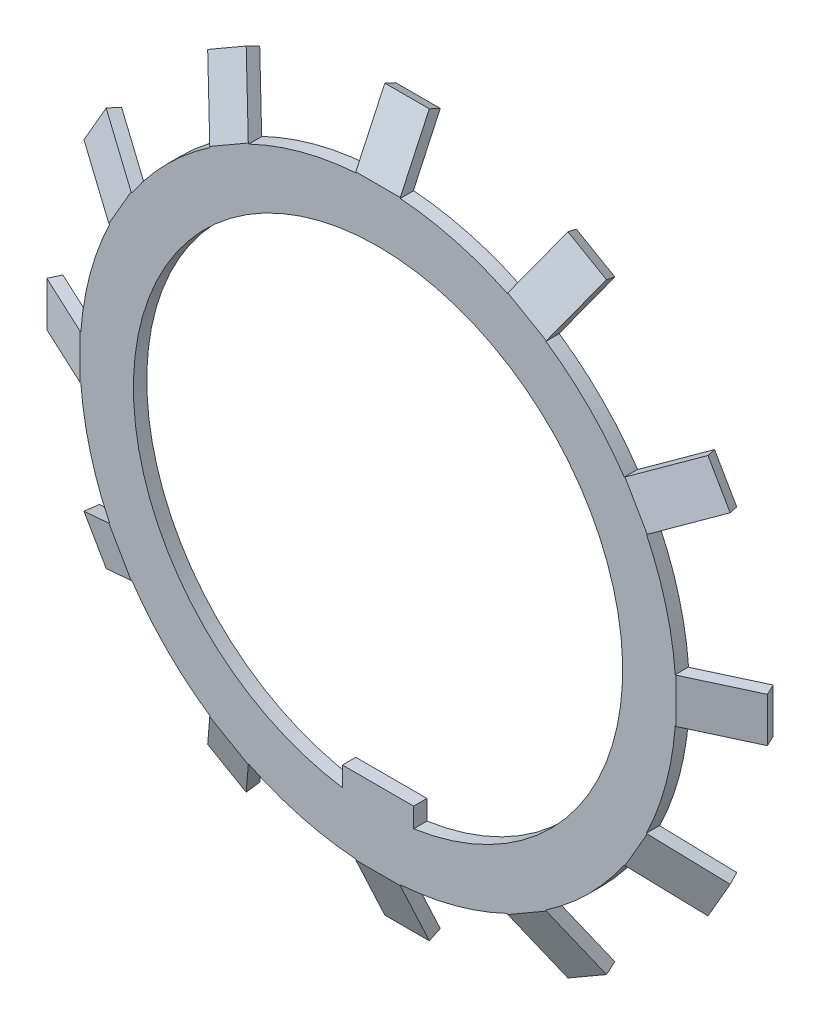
from build123d import *

# Parameters (mm, degrees)
ESQUISSE1_R                  = 33.5
BASE_EXTRUSION_DEPTH         = 1.5
BOSS_EXTRU_1_START           = -2.5
BOSS_EXTRU_1_DEPTH           = 5
R_P_TITION_CIRCULAIRE1_COUNT = 12


with BuildPart() as part:
    # Esquisse1 → Base-Extrusion (new body)
    with BuildSketch(Plane.XY):
        Circle(ESQUISSE1_R)
        with BuildLine():
            Line((-4, -27.207535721), (-4, -25))
            Line((-4, -25), (4, -25))
            Line((4, -25), (4, -27.207535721))
            ThreePointArc((4, -27.207535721), (0, 27.5), (-4, -27.207535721))
        make_face(mode=Mode.SUBTRACT)
    extrude(amount=BASE_EXTRUSION_DEPTH)

    # Esquisse2 → Boss.-Extru.1 (add)
    with BuildSketch(Plane(origin=(0, 0, 0), x_dir=(1, 0, 0), z_dir=(0, 1, 0)).offset(BOSS_EXTRU_1_START)):
        Polygon((33.5, -1.5), (40.5, 1.764153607), (39.925466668, 2.996244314), (33.5, 0), (27.5, 0), (27.5, -1.5), align=None)
    boss_extru_1 = extrude(amount=BOSS_EXTRU_1_DEPTH)

    # R_p_tition circulaire1: Boss.-Extru.1 ×12 about axis
    r_p_tition_circulaire1_axis = Axis((0, 0, 0), (0, 0, -1))
    for i in range(1, R_P_TITION_CIRCULAIRE1_COUNT):
        add(boss_extru_1.rotate(r_p_tition_circulaire1_axis, i * 360 / R_P_TITION_CIRCULAIRE1_COUNT))


solid = part.part
